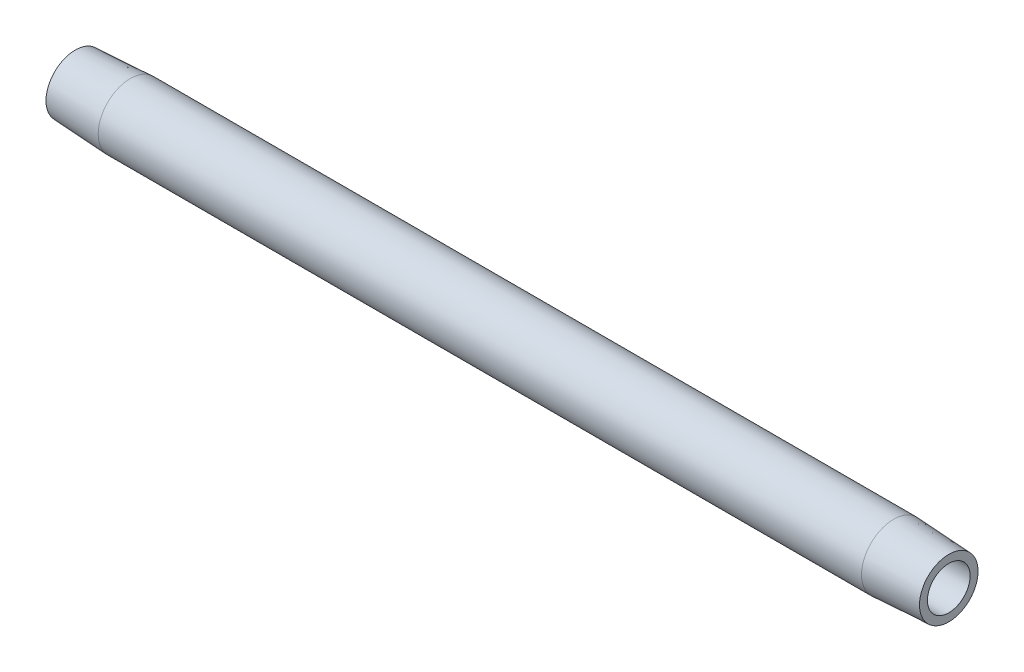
from build123d import *


with BuildPart() as part:
    # Sketch2 → Revolve1 (revolve)
    with BuildSketch(Plane.XY, mode=Mode.PRIVATE) as revolve1_sk:
        Polygon((8.810039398, 5.1435), (0, 4.6817854), (0, 3.4163), (139.7, 3.4163), (139.7, 4.6817854), (130.889960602, 5.1435), align=None)
    revolve(revolve1_sk.sketch.rotate(Axis((0.476141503, 0, 0), (1, 0, 0)), 90), axis=Axis((0.476141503, 0, 0), (1, 0, 0)))


solid = part.part
